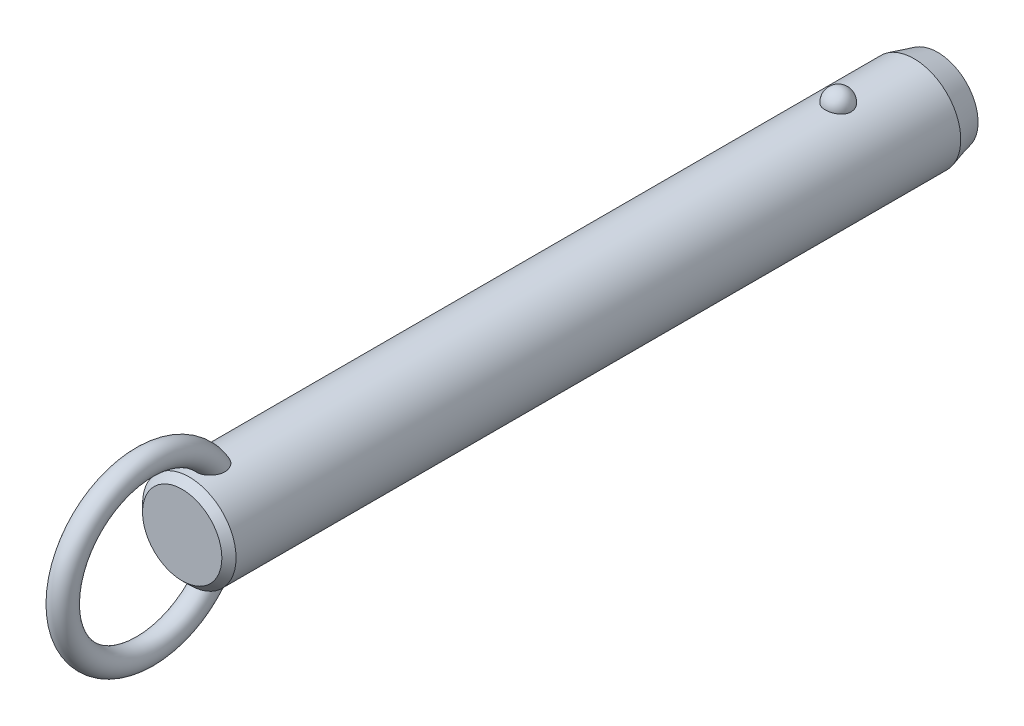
ISO-10303-21;
HEADER;
FILE_DESCRIPTION(('STEP AP214'),'2;1');
FILE_NAME('part.step','',(''),(''),'','','');
FILE_SCHEMA(('AUTOMOTIVE_DESIGN { 1 0 10303 214 1 1 1 1 }'));
ENDSEC;
DATA;
#1=APPLICATION_CONTEXT('core data for automotive mechanical design processes');
#2=APPLICATION_PROTOCOL_DEFINITION('international standard','automotive_design',2000,#1);
#3=PRODUCT_CONTEXT('',#1,'mechanical');
#4=PRODUCT('Part','Part','',(#3));
#5=PRODUCT_RELATED_PRODUCT_CATEGORY('part','',(#4));
#6=PRODUCT_DEFINITION_FORMATION('','',#4);
#7=PRODUCT_DEFINITION_CONTEXT('part definition',#1,'design');
#8=PRODUCT_DEFINITION('design','',#6,#7);
#9=PRODUCT_DEFINITION_SHAPE('','',#8);
#10=(LENGTH_UNIT() NAMED_UNIT(*) SI_UNIT(.MILLI.,.METRE.));
#11=(NAMED_UNIT(*) PLANE_ANGLE_UNIT() SI_UNIT($,.RADIAN.));
#12=(NAMED_UNIT(*) SI_UNIT($,.STERADIAN.) SOLID_ANGLE_UNIT());
#13=UNCERTAINTY_MEASURE_WITH_UNIT(LENGTH_MEASURE(1.E-05),#10,'distance_accuracy_value','');
#14=(GEOMETRIC_REPRESENTATION_CONTEXT(3) GLOBAL_UNCERTAINTY_ASSIGNED_CONTEXT((#13)) GLOBAL_UNIT_ASSIGNED_CONTEXT((#10,
#11,#12)) REPRESENTATION_CONTEXT('',''));
#15=CARTESIAN_POINT('',(0.,0.,0.));
#16=DIRECTION('',(0.,0.,1.));
#17=DIRECTION('',(1.,0.,0.));
#18=AXIS2_PLACEMENT_3D('',#15,#16,#17);
#19=CARTESIAN_POINT('',(0.,0.,99.1));
#20=DIRECTION('',(0.,0.,-1.));
#21=DIRECTION('',(-1.,0.,0.));
#22=AXIS2_PLACEMENT_3D('',#19,#20,#21);
#23=CYLINDRICAL_SURFACE('',#22,7.9);
#24=CARTESIAN_POINT('',(2.1785689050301,7.59367088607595,-2.19999999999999));
#25=CARTESIAN_POINT('',(2.17856679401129,7.59367269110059,-2.07701843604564));
#26=CARTESIAN_POINT('',(2.16853481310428,7.59657145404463,-1.95401006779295));
#27=CARTESIAN_POINT('',(2.12864689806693,7.607843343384,-1.71147811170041));
#28=CARTESIAN_POINT('',(2.09878338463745,7.61621856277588,-1.59195587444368));
#29=CARTESIAN_POINT('',(2.0199931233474,7.63749180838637,-1.3598563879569));
#30=CARTESIAN_POINT('',(1.97107475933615,7.6503878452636,-1.24727610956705));
#31=CARTESIAN_POINT('',(1.85539377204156,7.67926115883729,-1.03213234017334));
#32=CARTESIAN_POINT('',(1.78863158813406,7.69523835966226,-0.929568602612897));
#33=CARTESIAN_POINT('',(1.63856494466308,7.7285848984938,-0.736786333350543));
#34=CARTESIAN_POINT('',(1.55518140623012,7.7459606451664,-0.646630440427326));
#35=CARTESIAN_POINT('',(1.37422937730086,7.78009978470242,-0.481747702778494));
#36=CARTESIAN_POINT('',(1.27666086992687,7.79686317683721,-0.407020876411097));
#37=CARTESIAN_POINT('',(1.07024728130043,7.82786153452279,-0.275278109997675));
#38=CARTESIAN_POINT('',(0.961434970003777,7.84210353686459,-0.218212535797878));
#39=CARTESIAN_POINT('',(0.735351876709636,7.86652194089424,-0.123146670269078));
#40=CARTESIAN_POINT('',(0.618082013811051,7.87669878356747,-0.085144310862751));
#41=CARTESIAN_POINT('',(0.380637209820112,7.89170521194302,-0.0298158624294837));
#42=CARTESIAN_POINT('',(0.260550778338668,7.89662650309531,-0.0121347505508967));
#43=CARTESIAN_POINT('',(0.0190117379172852,7.90090003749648,0.00324379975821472));
#44=CARTESIAN_POINT('',(-0.102440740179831,7.90025280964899,0.00094313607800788));
#45=CARTESIAN_POINT('',(-0.341452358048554,7.89351056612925,-0.0233955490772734));
#46=CARTESIAN_POINT('',(-0.459042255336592,7.88749257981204,-0.0451545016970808));
#47=CARTESIAN_POINT('',(-0.688796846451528,7.87075812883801,-0.107408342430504));
#48=CARTESIAN_POINT('',(-0.800961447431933,7.86004158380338,-0.147903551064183));
#49=CARTESIAN_POINT('',(-1.01743634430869,7.83497131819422,-0.246799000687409));
#50=CARTESIAN_POINT('',(-1.12169791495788,7.82059709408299,-0.305300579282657));
#51=CARTESIAN_POINT('',(-1.31891765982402,7.78976470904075,-0.438549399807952));
#52=CARTESIAN_POINT('',(-1.41187469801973,7.77330633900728,-0.513298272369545));
#53=CARTESIAN_POINT('',(-1.58577142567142,7.73972434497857,-0.678622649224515));
#54=CARTESIAN_POINT('',(-1.66645140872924,7.72259402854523,-0.769470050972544));
#55=CARTESIAN_POINT('',(-1.81161503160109,7.68983776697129,-0.963538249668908));
#56=CARTESIAN_POINT('',(-1.87609753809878,7.6742119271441,-1.06675991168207));
#57=CARTESIAN_POINT('',(-1.98790138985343,7.6460202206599,-1.28401170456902));
#58=CARTESIAN_POINT('',(-2.03501994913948,7.63349104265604,-1.39815107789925));
#59=CARTESIAN_POINT('',(-2.10986724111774,7.6131449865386,-1.63301784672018));
#60=CARTESIAN_POINT('',(-2.1375965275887,7.60532797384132,-1.75374505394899));
#61=CARTESIAN_POINT('',(-2.17289256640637,7.5953195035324,-1.99782562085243));
#62=CARTESIAN_POINT('',(-2.18054294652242,7.59310471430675,-2.12116592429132));
#63=CARTESIAN_POINT('',(-2.17572919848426,7.59448538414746,-2.36741799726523));
#64=CARTESIAN_POINT('',(-2.1632656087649,7.59808068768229,-2.49032977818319));
#65=CARTESIAN_POINT('',(-2.11865035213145,7.61064035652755,-2.73161015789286));
#66=CARTESIAN_POINT('',(-2.08659579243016,7.61957823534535,-2.84999812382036));
#67=CARTESIAN_POINT('',(-2.00367799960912,7.64179982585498,-3.07955956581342));
#68=CARTESIAN_POINT('',(-1.9528140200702,7.65508371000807,-3.19073275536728));
#69=CARTESIAN_POINT('',(-1.83321113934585,7.68460381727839,-3.40337899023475));
#70=CARTESIAN_POINT('',(-1.76437735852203,7.70085556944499,-3.50479651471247));
#71=CARTESIAN_POINT('',(-1.61069526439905,7.73445734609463,-3.69446912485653));
#72=CARTESIAN_POINT('',(-1.52584634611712,7.75180741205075,-3.78272371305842));
#73=CARTESIAN_POINT('',(-1.34198059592,7.78574608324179,-3.94393987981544));
#74=CARTESIAN_POINT('',(-1.24291308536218,7.80233167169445,-4.01684434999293));
#75=CARTESIAN_POINT('',(-1.03352039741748,7.83281625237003,-4.14489386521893));
#76=CARTESIAN_POINT('',(-0.92319600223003,7.84671543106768,-4.20004014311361));
#77=CARTESIAN_POINT('',(-0.695822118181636,7.87011575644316,-4.29042017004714));
#78=CARTESIAN_POINT('',(-0.578872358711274,7.87966903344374,-4.32589112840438));
#79=CARTESIAN_POINT('',(-0.340410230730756,7.8935652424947,-4.37692226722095));
#80=CARTESIAN_POINT('',(-0.218898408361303,7.89790879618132,-4.39248482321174));
#81=CARTESIAN_POINT('',(0.0228107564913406,7.90087453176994,-4.40314405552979));
#82=CARTESIAN_POINT('',(0.142990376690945,7.89960185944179,-4.39861683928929));
#83=CARTESIAN_POINT('',(0.380829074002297,7.89171262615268,-4.37008293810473));
#84=CARTESIAN_POINT('',(0.498488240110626,7.8850962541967,-4.34607694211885));
#85=CARTESIAN_POINT('',(0.727535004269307,7.86726442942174,-4.27939317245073));
#86=CARTESIAN_POINT('',(0.838944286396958,7.85606616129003,-4.236785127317));
#87=CARTESIAN_POINT('',(1.05295421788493,7.83025654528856,-4.13408348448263));
#88=CARTESIAN_POINT('',(1.15555431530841,7.81564498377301,-4.07398879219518));
#89=CARTESIAN_POINT('',(1.35076763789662,7.7843022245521,-3.93687432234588));
#90=CARTESIAN_POINT('',(1.4432046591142,7.76754209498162,-3.85961036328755));
#91=CARTESIAN_POINT('',(1.6139111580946,7.73387857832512,-3.69076949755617));
#92=CARTESIAN_POINT('',(1.6921781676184,7.71697516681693,-3.59919010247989));
#93=CARTESIAN_POINT('',(1.83380875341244,7.6845643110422,-3.40247278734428));
#94=CARTESIAN_POINT('',(1.89689280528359,7.66908588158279,-3.29712873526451));
#95=CARTESIAN_POINT('',(2.0047823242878,7.64159441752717,-3.07707931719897));
#96=CARTESIAN_POINT('',(2.0495945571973,7.62958010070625,-2.96237743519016));
#97=CARTESIAN_POINT('',(2.11580183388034,7.61146617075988,-2.74040519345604));
#98=CARTESIAN_POINT('',(2.13929812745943,7.60484503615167,-2.63379846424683));
#99=CARTESIAN_POINT('',(2.17068242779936,7.59594664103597,-2.41813481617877));
#100=CARTESIAN_POINT('',(2.17857077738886,7.59366928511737,-2.30907795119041));
#101=CARTESIAN_POINT('',(2.1785689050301,7.59367088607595,-2.19999999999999));
#102=B_SPLINE_CURVE_WITH_KNOTS('',3,(#24,#25,#26,#27,#28,#29,#30,#31,#32,#33,#34,#35,#36,#37,
#38,#39,#40,#41,#42,#43,#44,#45,#46,#47,#48,#49,#50,#51,#52,#53,#54,#55,#56,#57,#58,#59,#60,#61,
#62,#63,#64,#65,#66,#67,#68,#69,#70,#71,#72,#73,#74,#75,#76,#77,#78,#79,#80,#81,#82,#83,#84,#85,
#86,#87,#88,#89,#90,#91,#92,#93,#94,#95,#96,#97,#98,#99,#100,#101),.UNSPECIFIED.,.T.,.F.,(4,2,2,
2,2,2,2,2,2,2,2,2,2,2,2,2,2,2,2,2,2,2,2,2,2,2,2,2,2,2,2,2,2,2,2,2,2,2,4),(0.,0.368552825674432,
0.737246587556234,1.10577831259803,1.4743009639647,1.8446206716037,2.21494081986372,
2.5842105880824,2.95344028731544,3.31611630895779,3.67875788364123,4.03628044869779,
4.39380913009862,4.75338791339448,5.11300280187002,5.47939989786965,5.8458226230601,
6.21639834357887,6.58696347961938,6.95598276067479,7.32499216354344,7.69218715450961,
8.0593967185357,8.42858578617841,8.79778880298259,9.16834203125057,9.5388695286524,
9.90482699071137,10.2707407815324,10.6298333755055,10.9889132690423,11.3466585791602,
11.7044262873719,12.0676511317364,12.4309391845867,12.8004764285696,13.1698767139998,
13.4967701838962,13.8236564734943),.UNSPECIFIED.);
#103=CARTESIAN_POINT('',(2.1785689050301,7.59367088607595,-2.19999999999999));
#104=VERTEX_POINT('',#103);
#105=EDGE_CURVE('E41',#104,#104,#102,.T.);
#106=ORIENTED_EDGE('',*,*,#105,.T.);
#107=EDGE_LOOP('',(#106));
#108=FACE_BOUND('',#107,.T.);
#109=CARTESIAN_POINT('',(0.,0.,107.42));
#110=DIRECTION('',(0.,0.,1.));
#111=DIRECTION('',(1.,0.,0.));
#112=AXIS2_PLACEMENT_3D('',#109,#110,#111);
#113=CIRCLE('',#112,7.9);
#114=CARTESIAN_POINT('',(7.9,0.,107.42));
#115=VERTEX_POINT('',#114);
#116=EDGE_CURVE('E10',#115,#115,#113,.F.);
#117=ORIENTED_EDGE('',*,*,#116,.T.);
#118=EDGE_LOOP('',(#117));
#119=FACE_BOUND('',#118,.T.);
#120=CARTESIAN_POINT('',(-0.630969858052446,-7.87476203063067,101.312432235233));
#121=CARTESIAN_POINT('',(-0.73418033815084,-7.8664899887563,101.347285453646));
#122=CARTESIAN_POINT('',(-0.834476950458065,-7.85639291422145,101.390816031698));
#123=CARTESIAN_POINT('',(-1.02620356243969,-7.83366343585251,101.494094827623));
#124=CARTESIAN_POINT('',(-1.1176141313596,-7.82102565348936,101.553877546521));
#125=CARTESIAN_POINT('',(-1.28877277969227,-7.79464922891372,101.687839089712));
#126=CARTESIAN_POINT('',(-1.36854014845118,-7.78091246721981,101.761993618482));
#127=CARTESIAN_POINT('',(-1.5146152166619,-7.75380398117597,101.922494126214));
#128=CARTESIAN_POINT('',(-1.58092966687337,-7.74043207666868,102.008833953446));
#129=CARTESIAN_POINT('',(-1.70019064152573,-7.71512522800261,102.192978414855));
#130=CARTESIAN_POINT('',(-1.75284037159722,-7.70322473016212,102.290979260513));
#131=CARTESIAN_POINT('',(-1.84263464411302,-7.68224112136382,102.494102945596));
#132=CARTESIAN_POINT('',(-1.87977299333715,-7.6731591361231,102.599228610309));
#133=CARTESIAN_POINT('',(-1.94152728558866,-7.65777930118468,102.823284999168));
#134=CARTESIAN_POINT('',(-1.96475471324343,-7.65179654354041,102.942616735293));
#135=CARTESIAN_POINT('',(-1.99449499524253,-7.64409642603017,103.18342986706));
#136=CARTESIAN_POINT('',(-2.0010005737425,-7.64238092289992,103.304912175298));
#137=CARTESIAN_POINT('',(-1.99856014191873,-7.64302120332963,103.568340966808));
#138=CARTESIAN_POINT('',(-1.98680021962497,-7.64611845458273,103.71025654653));
#139=CARTESIAN_POINT('',(-1.94457772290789,-7.65696186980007,103.991118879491));
#140=CARTESIAN_POINT('',(-1.91409393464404,-7.66471330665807,104.130062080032));
#141=CARTESIAN_POINT('',(-1.82768670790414,-7.68582947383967,104.431939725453));
#142=CARTESIAN_POINT('',(-1.76772963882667,-7.70003779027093,104.593686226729));
#143=CARTESIAN_POINT('',(-1.65998501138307,-7.72371550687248,104.827695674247));
#144=CARTESIAN_POINT('',(-1.621079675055,-7.73200670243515,104.904297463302));
#145=CARTESIAN_POINT('',(-1.53727726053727,-7.74910377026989,105.054079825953));
#146=CARTESIAN_POINT('',(-1.49238215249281,-7.75790947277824,105.127261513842));
#147=CARTESIAN_POINT('',(-1.3739705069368,-7.77993338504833,105.30288382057));
#148=CARTESIAN_POINT('',(-1.29690364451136,-7.79328473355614,105.402955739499));
#149=CARTESIAN_POINT('',(-1.1288548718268,-7.81939266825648,105.590714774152));
#150=CARTESIAN_POINT('',(-1.03789926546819,-7.83215032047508,105.678424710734));
#151=CARTESIAN_POINT('',(-0.869532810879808,-7.85231710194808,105.813414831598));
#152=CARTESIAN_POINT('',(-0.795716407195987,-7.86021093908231,105.865076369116));
#153=CARTESIAN_POINT('',(-0.640813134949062,-7.87434920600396,105.956381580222));
#154=CARTESIAN_POINT('',(-0.559737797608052,-7.88059619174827,105.99604389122));
#155=CARTESIAN_POINT('',(-0.406456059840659,-7.88984116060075,106.054300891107));
#156=CARTESIAN_POINT('',(-0.335227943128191,-7.89321892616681,106.075384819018));
#157=CARTESIAN_POINT('',(-0.19019307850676,-7.89804235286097,106.10541418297));
#158=CARTESIAN_POINT('',(-0.11638863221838,-7.89948969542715,106.114370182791));
#159=CARTESIAN_POINT('',(0.0318414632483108,-7.90028409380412,106.119291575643));
#160=CARTESIAN_POINT('',(0.106268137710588,-7.89962640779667,106.115227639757));
#161=CARTESIAN_POINT('',(0.253290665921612,-7.8962818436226,106.094461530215));
#162=CARTESIAN_POINT('',(0.32588518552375,-7.8935935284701,106.077750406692));
#163=CARTESIAN_POINT('',(0.481441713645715,-7.88577340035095,106.028738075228));
#164=CARTESIAN_POINT('',(0.563611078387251,-7.88026321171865,105.994005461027));
#165=CARTESIAN_POINT('',(0.721129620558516,-7.86741729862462,105.911796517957));
#166=CARTESIAN_POINT('',(0.796466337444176,-7.86007832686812,105.864297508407));
#167=CARTESIAN_POINT('',(0.971456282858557,-7.84073285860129,105.736513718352));
#168=CARTESIAN_POINT('',(1.0671968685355,-7.82809461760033,105.651004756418));
#169=CARTESIAN_POINT('',(1.24418921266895,-7.80192439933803,105.466232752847));
#170=CARTESIAN_POINT('',(1.32540832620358,-7.78839049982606,105.366939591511));
#171=CARTESIAN_POINT('',(1.45199971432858,-7.76559693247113,105.189576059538));
#172=CARTESIAN_POINT('',(1.50085649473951,-7.75626094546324,105.113954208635));
#173=CARTESIAN_POINT('',(1.59197749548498,-7.7380727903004,104.958742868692));
#174=CARTESIAN_POINT('',(1.63423919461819,-7.72922080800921,104.879151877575));
#175=CARTESIAN_POINT('',(1.71222612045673,-7.71231959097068,104.716664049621));
#176=CARTESIAN_POINT('',(1.74794516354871,-7.70427111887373,104.633764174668));
#177=CARTESIAN_POINT('',(1.81270113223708,-7.68929240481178,104.465296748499));
#178=CARTESIAN_POINT('',(1.84173789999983,-7.68236218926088,104.379729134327));
#179=CARTESIAN_POINT('',(1.89322698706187,-7.66983757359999,104.20528702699));
#180=CARTESIAN_POINT('',(1.91558744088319,-7.66426199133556,104.116383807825));
#181=CARTESIAN_POINT('',(1.95281367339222,-7.65485915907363,103.936969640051));
#182=CARTESIAN_POINT('',(1.96767946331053,-7.65103190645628,103.846458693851));
#183=CARTESIAN_POINT('',(2.00021456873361,-7.64262981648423,103.573732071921));
#184=CARTESIAN_POINT('',(2.00600691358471,-7.6410871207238,103.389709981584));
#185=CARTESIAN_POINT('',(1.98445334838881,-7.64669564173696,103.076501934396));
#186=CARTESIAN_POINT('',(1.96607186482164,-7.65149688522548,102.946618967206));
#187=CARTESIAN_POINT('',(1.90884967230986,-7.6659762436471,102.691632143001));
#188=CARTESIAN_POINT('',(1.8700210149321,-7.67565148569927,102.566525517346));
#189=CARTESIAN_POINT('',(1.77063986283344,-7.69918471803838,102.32454013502));
#190=CARTESIAN_POINT('',(1.70993724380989,-7.71307150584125,102.207725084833));
#191=CARTESIAN_POINT('',(1.5673307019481,-7.74330306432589,101.988144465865));
#192=CARTESIAN_POINT('',(1.48543692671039,-7.75964665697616,101.885372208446));
#193=CARTESIAN_POINT('',(1.31346177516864,-7.79047523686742,101.709380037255));
#194=CARTESIAN_POINT('',(1.22547278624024,-7.80495298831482,101.634106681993));
#195=CARTESIAN_POINT('',(1.03724352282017,-7.83218597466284,101.500486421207));
#196=CARTESIAN_POINT('',(0.937008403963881,-7.84494192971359,101.442132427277));
#197=CARTESIAN_POINT('',(0.733599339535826,-7.86649045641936,101.347027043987));
#198=CARTESIAN_POINT('',(0.630941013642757,-7.87547134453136,101.309210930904));
#199=CARTESIAN_POINT('',(0.420465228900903,-7.88950708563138,101.251116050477));
#200=CARTESIAN_POINT('',(0.312645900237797,-7.89456050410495,101.23084369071));
#201=CARTESIAN_POINT('',(0.0960869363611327,-7.9001518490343,101.208455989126));
#202=CARTESIAN_POINT('',(-0.0126341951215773,-7.90073226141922,101.206169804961));
#203=CARTESIAN_POINT('',(-0.228766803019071,-7.89742350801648,101.219367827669));
#204=CARTESIAN_POINT('',(-0.336180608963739,-7.89354403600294,101.234813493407));
#205=CARTESIAN_POINT('',(-0.473410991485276,-7.88586871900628,101.266217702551));
#206=CARTESIAN_POINT('',(-0.50525779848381,-7.88388984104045,101.274354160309));
#207=CARTESIAN_POINT('',(-0.5684812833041,-7.87958326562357,101.292208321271));
#208=CARTESIAN_POINT('',(-0.599857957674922,-7.87725556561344,101.301926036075));
#209=CARTESIAN_POINT('',(-0.630969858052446,-7.87476203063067,101.312432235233));
#210=B_SPLINE_CURVE_WITH_KNOTS('',3,(#120,#121,#122,#123,#124,#125,#126,#127,#128,#129,#130,
#131,#132,#133,#134,#135,#136,#137,#138,#139,#140,#141,#142,#143,#144,#145,#146,#147,#148,#149,
#150,#151,#152,#153,#154,#155,#156,#157,#158,#159,#160,#161,#162,#163,#164,#165,#166,#167,#168,
#169,#170,#171,#172,#173,#174,#175,#176,#177,#178,#179,#180,#181,#182,#183,#184,#185,#186,#187,
#188,#189,#190,#191,#192,#193,#194,#195,#196,#197,#198,#199,#200,#201,#202,#203,#204,#205,#206,
#207,#208,#209),.UNSPECIFIED.,.T.,.F.,(4,2,2,2,2,2,2,2,2,2,2,2,2,2,2,2,2,2,2,2,2,2,2,2,2,2,2,2,
2,2,2,2,2,2,2,2,2,2,2,2,2,2,2,2,4),(0.,0.327622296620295,0.655945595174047,0.983718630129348,
1.3113267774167,1.64554655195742,1.9798996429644,2.3436572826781,2.70757317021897,
3.13333684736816,3.55958380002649,4.07655306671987,4.3352789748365,4.59391999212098,
4.97382437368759,5.35301797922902,5.62348245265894,5.89352465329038,6.11565959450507,
6.3376009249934,6.56004255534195,6.78264174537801,7.04930844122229,7.31645206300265,
7.70130871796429,8.08701995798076,8.35824509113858,8.62957365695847,8.90115735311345,
9.17274746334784,9.44791855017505,9.72308922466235,10.2715298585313,10.6638393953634,
11.0559179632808,11.4507403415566,11.845374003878,12.1936425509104,12.5417649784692,
12.8695063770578,13.1973674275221,13.5221104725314,13.8461490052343,13.9449071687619,
14.0436660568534),.UNSPECIFIED.);
#211=CARTESIAN_POINT('',(-0.630969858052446,-7.87476203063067,101.312432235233));
#212=VERTEX_POINT('',#211);
#213=EDGE_CURVE('E59',#212,#212,#210,.T.);
#214=ORIENTED_EDGE('',*,*,#213,.T.);
#215=EDGE_LOOP('',(#214));
#216=FACE_BOUND('',#215,.T.);
#217=CARTESIAN_POINT('',(-0.630969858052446,7.87476203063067,101.312432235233));
#218=CARTESIAN_POINT('',(-0.528918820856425,7.88293636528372,101.277979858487));
#219=CARTESIAN_POINT('',(-0.423745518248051,7.8893481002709,101.251915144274));
#220=CARTESIAN_POINT('',(-0.210236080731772,7.8979273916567,101.217282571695));
#221=CARTESIAN_POINT('',(-0.10189380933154,7.90008607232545,101.208751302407));
#222=CARTESIAN_POINT('',(0.114660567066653,7.89990877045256,101.209457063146));
#223=CARTESIAN_POINT('',(0.222872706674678,7.89757640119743,101.21867980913));
#224=CARTESIAN_POINT('',(0.436107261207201,7.88867538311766,101.254652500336));
#225=CARTESIAN_POINT('',(0.541131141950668,7.8821087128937,101.28139425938));
#226=CARTESIAN_POINT('',(0.745085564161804,7.86545130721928,101.351756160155));
#227=CARTESIAN_POINT('',(0.844015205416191,7.85536005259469,101.395378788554));
#228=CARTESIAN_POINT('',(1.03299167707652,7.83275153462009,101.498379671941));
#229=CARTESIAN_POINT('',(1.12303841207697,7.8202342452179,101.557758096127));
#230=CARTESIAN_POINT('',(1.29214734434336,7.79408219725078,101.690864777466));
#231=CARTESIAN_POINT('',(1.37116907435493,7.78044359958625,101.764643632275));
#232=CARTESIAN_POINT('',(1.51597677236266,7.75353170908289,101.924235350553));
#233=CARTESIAN_POINT('',(1.58176261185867,7.74025841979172,102.010048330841));
#234=CARTESIAN_POINT('',(1.70057386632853,7.71504069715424,102.193644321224));
#235=CARTESIAN_POINT('',(1.75320073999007,7.70314257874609,102.291690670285));
#236=CARTESIAN_POINT('',(1.84293767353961,7.68216822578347,102.494893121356));
#237=CARTESIAN_POINT('',(1.88004278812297,7.67309289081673,102.600051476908));
#238=CARTESIAN_POINT('',(1.9417232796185,7.6577294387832,102.824167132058));
#239=CARTESIAN_POINT('',(1.96491037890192,7.65175648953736,102.943524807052));
#240=CARTESIAN_POINT('',(1.9945689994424,7.64407702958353,103.184384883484));
#241=CARTESIAN_POINT('',(2.00103304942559,7.64237242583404,103.30588821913));
#242=CARTESIAN_POINT('',(1.9985016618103,7.64303650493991,103.569368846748));
#243=CARTESIAN_POINT('',(1.98669038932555,7.64614714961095,103.711314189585));
#244=CARTESIAN_POINT('',(1.94436120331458,7.6570170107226,103.992228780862));
#245=CARTESIAN_POINT('',(1.91382203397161,7.66478150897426,104.131194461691));
#246=CARTESIAN_POINT('',(1.82728754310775,7.68592483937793,104.433111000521));
#247=CARTESIAN_POINT('',(1.76725778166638,7.70014685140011,104.594872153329));
#248=CARTESIAN_POINT('',(1.65939700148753,7.72384204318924,104.828891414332));
#249=CARTESIAN_POINT('',(1.62045187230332,7.73213852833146,104.905494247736));
#250=CARTESIAN_POINT('',(1.53656684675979,7.74924489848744,105.055273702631));
#251=CARTESIAN_POINT('',(1.49162892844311,7.75805461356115,105.128451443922));
#252=CARTESIAN_POINT('',(1.37317698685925,7.78007342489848,105.303952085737));
#253=CARTESIAN_POINT('',(1.29612360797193,7.79341423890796,105.403911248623));
#254=CARTESIAN_POINT('',(1.12812043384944,7.81949839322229,105.59145083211));
#255=CARTESIAN_POINT('',(1.03719688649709,7.83224280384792,105.679054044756));
#256=CARTESIAN_POINT('',(0.868871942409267,7.85239026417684,105.81389715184));
#257=CARTESIAN_POINT('',(0.795056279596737,7.86027769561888,105.865511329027));
#258=CARTESIAN_POINT('',(0.640160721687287,7.87440222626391,105.956720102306));
#259=CARTESIAN_POINT('',(0.559092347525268,7.88064188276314,105.996333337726));
#260=CARTESIAN_POINT('',(0.405820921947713,7.8898738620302,106.054505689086));
#261=CARTESIAN_POINT('',(0.334594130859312,7.89324577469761,106.075552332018));
#262=CARTESIAN_POINT('',(0.189568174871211,7.89805733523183,106.105507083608));
#263=CARTESIAN_POINT('',(0.115771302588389,7.89949866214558,106.114425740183));
#264=CARTESIAN_POINT('',(-0.0324359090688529,7.90028156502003,106.11927589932));
#265=CARTESIAN_POINT('',(-0.106847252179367,7.89961843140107,106.115178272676));
#266=CARTESIAN_POINT('',(-0.253834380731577,7.8962642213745,106.094351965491));
#267=CARTESIAN_POINT('',(-0.326408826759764,7.89357170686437,106.077614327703));
#268=CARTESIAN_POINT('',(-0.481962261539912,7.88574179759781,106.028539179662));
#269=CARTESIAN_POINT('',(-0.564145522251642,7.88022507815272,105.993763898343));
#270=CARTESIAN_POINT('',(-0.721685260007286,7.86736646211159,105.911468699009));
#271=CARTESIAN_POINT('',(-0.797029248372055,7.8600213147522,105.863926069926));
#272=CARTESIAN_POINT('',(-0.972044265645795,7.84066026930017,105.736026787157));
#273=CARTESIAN_POINT('',(-1.06779803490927,7.82801274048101,105.650443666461));
#274=CARTESIAN_POINT('',(-1.24480531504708,7.80182621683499,105.465522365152));
#275=CARTESIAN_POINT('',(-1.32602618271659,7.78828530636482,105.366154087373));
#276=CARTESIAN_POINT('',(-1.45259834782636,7.76548487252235,105.188680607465));
#277=CARTESIAN_POINT('',(-1.50143856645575,7.75614818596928,105.113025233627));
#278=CARTESIAN_POINT('',(-1.59252410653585,7.73796020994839,104.957748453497));
#279=CARTESIAN_POINT('',(-1.63476690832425,7.72910910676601,104.878125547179));
#280=CARTESIAN_POINT('',(-1.71271318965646,7.71221133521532,104.715575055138));
#281=CARTESIAN_POINT('',(-1.74841047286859,7.70416543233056,104.632644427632));
#282=CARTESIAN_POINT('',(-1.81311929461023,7.6891937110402,104.464116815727));
#283=CARTESIAN_POINT('',(-1.84213067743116,7.6822679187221,104.378519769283));
#284=CARTESIAN_POINT('',(-1.89356259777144,7.66975461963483,104.204025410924));
#285=CARTESIAN_POINT('',(-1.91589165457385,7.66418586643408,104.115099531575));
#286=CARTESIAN_POINT('',(-1.95305070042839,7.65479859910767,103.935642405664));
#287=CARTESIAN_POINT('',(-1.96788069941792,7.65098008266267,103.845111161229));
#288=CARTESIAN_POINT('',(-2.00030078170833,7.64260704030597,103.572327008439));
#289=CARTESIAN_POINT('',(-2.00600576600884,7.64108760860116,103.388271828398));
#290=CARTESIAN_POINT('',(-1.98428483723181,7.64673945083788,103.075080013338));
#291=CARTESIAN_POINT('',(-1.96583698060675,7.6515575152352,102.945240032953));
#292=CARTESIAN_POINT('',(-1.90848948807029,7.66606613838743,102.690361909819));
#293=CARTESIAN_POINT('',(-1.86960376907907,7.67575338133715,102.565320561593));
#294=CARTESIAN_POINT('',(-1.7701342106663,7.69930132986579,102.323500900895));
#295=CARTESIAN_POINT('',(-1.70940488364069,7.71318991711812,102.206784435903));
#296=CARTESIAN_POINT('',(-1.56672953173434,7.74342495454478,101.987340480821));
#297=CARTESIAN_POINT('',(-1.48478316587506,7.75977144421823,101.88461321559));
#298=CARTESIAN_POINT('',(-1.31266325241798,7.79061163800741,101.708643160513));
#299=CARTESIAN_POINT('',(-1.22456383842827,7.80509908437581,101.633358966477));
#300=CARTESIAN_POINT('',(-1.03622400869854,7.83231881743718,101.499865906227));
#301=CARTESIAN_POINT('',(-0.936015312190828,7.84505551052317,101.441613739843));
#302=CARTESIAN_POINT('',(-0.798824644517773,7.85957802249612,101.377540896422));
#303=CARTESIAN_POINT('',(-0.765787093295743,7.86286821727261,101.363224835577));
#304=CARTESIAN_POINT('',(-0.698939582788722,7.86909211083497,101.336436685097));
#305=CARTESIAN_POINT('',(-0.66512963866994,7.8720258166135,101.323964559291));
#306=CARTESIAN_POINT('',(-0.630969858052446,7.87476203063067,101.312432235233));
#307=B_SPLINE_CURVE_WITH_KNOTS('',3,(#217,#218,#219,#220,#221,#222,#223,#224,#225,#226,#227,
#228,#229,#230,#231,#232,#233,#234,#235,#236,#237,#238,#239,#240,#241,#242,#243,#244,#245,#246,
#247,#248,#249,#250,#251,#252,#253,#254,#255,#256,#257,#258,#259,#260,#261,#262,#263,#264,#265,
#266,#267,#268,#269,#270,#271,#272,#273,#274,#275,#276,#277,#278,#279,#280,#281,#282,#283,#284,
#285,#286,#287,#288,#289,#290,#291,#292,#293,#294,#295,#296,#297,#298,#299,#300,#301,#302,#303,
#304,#305,#306),.UNSPECIFIED.,.T.,.F.,(4,2,2,2,2,2,2,2,2,2,2,2,2,2,2,2,2,2,2,2,2,2,2,2,2,2,2,2,
2,2,2,2,2,2,2,2,2,2,2,2,2,2,2,2,4),(0.,0.323920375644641,0.648516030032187,0.97285063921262,
1.29703380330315,1.62126473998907,1.94549915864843,2.27089401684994,2.5962920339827,
2.93059633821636,3.26500707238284,3.62881644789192,3.99278833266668,4.41865421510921,
4.84500434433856,5.36209210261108,5.62087589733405,5.87957448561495,6.25918598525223,
6.63808782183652,6.90846748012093,7.17842501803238,7.40052350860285,7.62242871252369,
7.84483086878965,8.06739077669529,8.33414615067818,8.60137921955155,8.98641454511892,
9.3723041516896,9.64358673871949,9.91497268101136,10.1866142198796,10.4582620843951,
10.7334745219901,11.0086865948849,11.5572126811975,11.9494246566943,12.3413699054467,
12.7359755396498,13.1305875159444,13.4791770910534,13.82687259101,13.9353013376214,
14.0437279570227),.UNSPECIFIED.);
#308=CARTESIAN_POINT('',(-0.630969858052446,7.87476203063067,101.312432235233));
#309=VERTEX_POINT('',#308);
#310=EDGE_CURVE('E67',#309,#309,#307,.T.);
#311=ORIENTED_EDGE('',*,*,#310,.T.);
#312=EDGE_LOOP('',(#311));
#313=FACE_BOUND('',#312,.T.);
#314=CARTESIAN_POINT('',(0.,0.,-14.9999999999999));
#315=DIRECTION('',(0.,0.,-1.));
#316=DIRECTION('',(-1.,0.,0.));
#317=AXIS2_PLACEMENT_3D('',#314,#315,#316);
#318=CIRCLE('',#317,7.9);
#319=CARTESIAN_POINT('',(-7.9,0.,-14.9999999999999));
#320=VERTEX_POINT('',#319);
#321=EDGE_CURVE('E56',#320,#320,#318,.F.);
#322=ORIENTED_EDGE('',*,*,#321,.T.);
#323=EDGE_LOOP('',(#322));
#324=FACE_BOUND('',#323,.T.);
#325=ADVANCED_FACE('F37',(#108,#119,#216,#313,#324),#23,.T.);
#326=CARTESIAN_POINT('',(0.,0.,-19.));
#327=DIRECTION('',(0.,0.,-1.));
#328=DIRECTION('',(-1.,0.,0.));
#329=AXIS2_PLACEMENT_3D('',#326,#327,#328);
#330=PLANE('',#329);
#331=CARTESIAN_POINT('',(0.,0.,-19.));
#332=DIRECTION('',(0.,0.,-1.));
#333=DIRECTION('',(-1.,0.,0.));
#334=AXIS2_PLACEMENT_3D('',#331,#332,#333);
#335=CIRCLE('',#334,6.82820323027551);
#336=CARTESIAN_POINT('',(-6.82820323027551,0.,-19.));
#337=VERTEX_POINT('',#336);
#338=EDGE_CURVE('E66',#337,#337,#335,.T.);
#339=ORIENTED_EDGE('',*,*,#338,.T.);
#340=EDGE_LOOP('',(#339));
#341=FACE_BOUND('',#340,.T.);
#342=ADVANCED_FACE('F85',(#341),#330,.T.);
#343=CARTESIAN_POINT('',(0.,0.,-19.));
#344=DIRECTION('',(0.,0.,1.));
#345=DIRECTION('',(1.,0.,0.));
#346=AXIS2_PLACEMENT_3D('',#343,#344,#345);
#347=CONICAL_SURFACE('',#346,6.8282032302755,0.261799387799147);
#348=ORIENTED_EDGE('',*,*,#321,.F.);
#349=EDGE_LOOP('',(#348));
#350=FACE_BOUND('',#349,.T.);
#351=ORIENTED_EDGE('',*,*,#338,.F.);
#352=EDGE_LOOP('',(#351));
#353=FACE_BOUND('',#352,.T.);
#354=ADVANCED_FACE('F83',(#350,#353),#347,.T.);
#355=CARTESIAN_POINT('',(0.,0.,108.62));
#356=DIRECTION('',(0.,0.,1.));
#357=DIRECTION('',(1.,0.,0.));
#358=AXIS2_PLACEMENT_3D('',#355,#356,#357);
#359=PLANE('',#358);
#360=CARTESIAN_POINT('',(0.,0.,108.62));
#361=DIRECTION('',(0.,0.,1.));
#362=DIRECTION('',(1.,0.,0.));
#363=AXIS2_PLACEMENT_3D('',#360,#361,#362);
#364=CIRCLE('',#363,6.70000000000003);
#365=CARTESIAN_POINT('',(6.70000000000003,0.,108.62));
#366=VERTEX_POINT('',#365);
#367=EDGE_CURVE('E50',#366,#366,#364,.T.);
#368=ORIENTED_EDGE('',*,*,#367,.T.);
#369=EDGE_LOOP('',(#368));
#370=FACE_BOUND('',#369,.T.);
#371=ADVANCED_FACE('F77',(#370),#359,.T.);
#372=CARTESIAN_POINT('',(0.,0.,114.95));
#373=DIRECTION('',(1.,0.,0.));
#374=DIRECTION('',(0.,0.,-1.));
#375=AXIS2_PLACEMENT_3D('',#372,#373,#374);
#376=TOROIDAL_SURFACE('',#375,13.85,2.);
#377=ORIENTED_EDGE('',*,*,#310,.F.);
#378=EDGE_LOOP('',(#377));
#379=FACE_BOUND('',#378,.T.);
#380=ORIENTED_EDGE('',*,*,#213,.F.);
#381=EDGE_LOOP('',(#380));
#382=FACE_BOUND('',#381,.T.);
#383=ADVANCED_FACE('F73',(#379,#382),#376,.T.);
#384=CARTESIAN_POINT('',(0.,0.,108.62));
#385=DIRECTION('',(0.,0.,-1.));
#386=DIRECTION('',(-1.,0.,0.));
#387=AXIS2_PLACEMENT_3D('',#384,#385,#386);
#388=CONICAL_SURFACE('',#387,6.70000000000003,0.785398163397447);
#389=ORIENTED_EDGE('',*,*,#116,.F.);
#390=EDGE_LOOP('',(#389));
#391=FACE_BOUND('',#390,.T.);
#392=ORIENTED_EDGE('',*,*,#367,.F.);
#393=EDGE_LOOP('',(#392));
#394=FACE_BOUND('',#393,.T.);
#395=ADVANCED_FACE('F39',(#391,#394),#388,.T.);
#396=CARTESIAN_POINT('',(0.,7.9,-2.19999999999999));
#397=DIRECTION('',(0.,1.,0.));
#398=DIRECTION('',(0.,0.,-1.));
#399=AXIS2_PLACEMENT_3D('',#396,#397,#398);
#400=SPHERICAL_SURFACE('',#399,2.2);
#401=ORIENTED_EDGE('',*,*,#105,.F.);
#402=EDGE_LOOP('',(#401));
#403=FACE_BOUND('',#402,.T.);
#404=ADVANCED_FACE('F79',(#403),#400,.T.);
#405=CLOSED_SHELL('',(#325,#342,#354,#371,#383,#395,#404));
#406=MANIFOLD_SOLID_BREP('B2',#405);
#407=ADVANCED_BREP_SHAPE_REPRESENTATION('',(#18,#406),#14);
#408=SHAPE_DEFINITION_REPRESENTATION(#9,#407);
ENDSEC;
END-ISO-10303-21;
